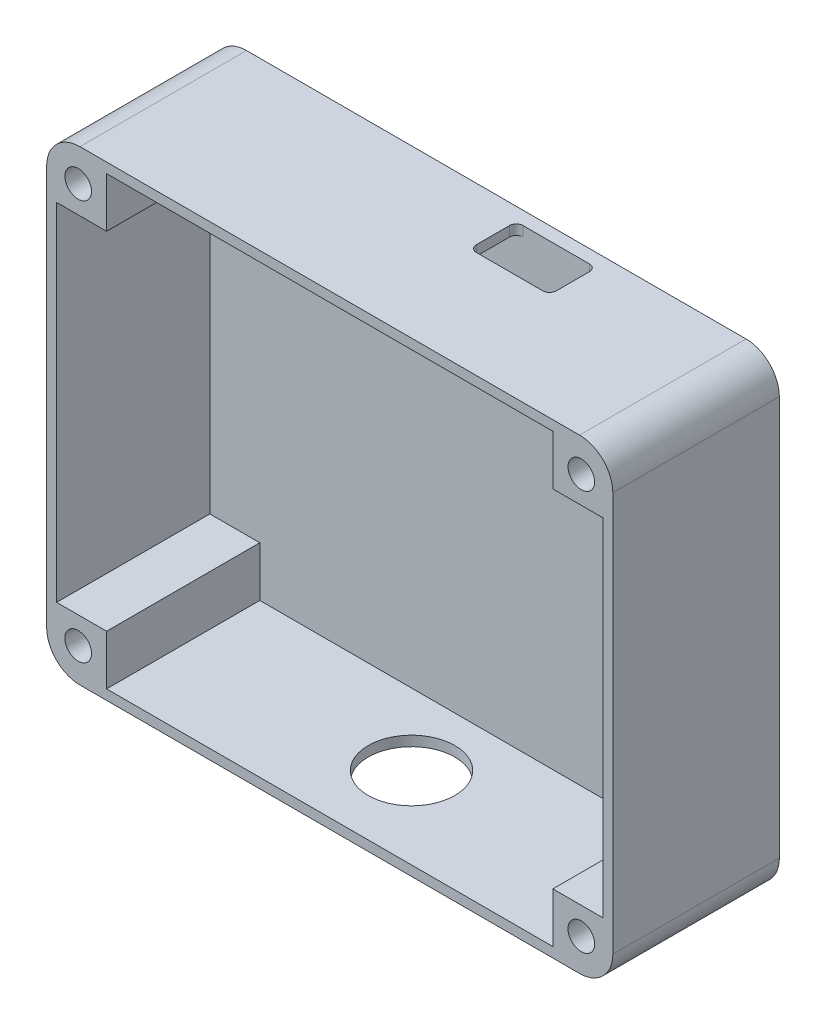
from build123d import *

# Parameters (mm, degrees)
BOSS_EXTRUDE1_DEPTH = 25
CUT_EXTRUDE1_DEPTH  = 23
SKETCH3_R           = 2
CUT_EXTRUDE2_DEPTH  = 23
CUT_EXTRUDE4_DEPTH  = 4
SKETCH5_R           = 6.5
CUT_EXTRUDE5_DEPTH  = 4


with BuildPart() as part:
    # Sketch1 → Boss-Extrude1 (new body)
    with BuildSketch(Plane.XY):
        with BuildLine():
            Line((-37.5, 35), (37.5, 35))
            ThreePointArc((37.5, 35), (41.035533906, 33.535533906), (42.5, 30))
            Line((42.5, 30), (42.5, -30))
            ThreePointArc((42.5, -30), (41.035533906, -33.535533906), (37.5, -35))
            Line((37.5, -35), (-37.5, -35))
            ThreePointArc((-37.5, -35), (-41.035533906, -33.535533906), (-42.5, -30))
            Line((-42.5, -30), (-42.5, 30))
            ThreePointArc((-42.5, 30), (-41.035533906, 33.535533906), (-37.5, 35))
        make_face()
    extrude(amount=BOSS_EXTRUDE1_DEPTH)

    # Sketch2 → Cut-Extrude1 (cut)
    with BuildSketch(Plane.XY.offset(25)):
        Polygon((33.5, 33.5), (-33.5, 33.5), (-33.5, 26), (-41, 26), (-41, -26), (-33.5, -26), (-33.5, -33.5), (33.5, -33.5), (33.5, -26), (41, -26), (41, 26), (33.5, 26), align=None)
    extrude(amount=-CUT_EXTRUDE1_DEPTH, mode=Mode.SUBTRACT)

    # Sketch3 → Cut-Extrude2 (cut)
    with BuildSketch(Plane.XY.offset(25)):
        with Locations((-37.768024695, 30.036604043)):
            Circle(SKETCH3_R)
        with Locations(Location((37.768024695, 30.036604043, 0), (0, 0, 180))):
            Circle(SKETCH3_R)
        with Locations((37.768024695, -30.036604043)):
            Circle(SKETCH3_R)
        with Locations(Location((-37.768024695, -30.036604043, 0), (0, 0, 180))):
            Circle(SKETCH3_R)
    extrude(amount=-CUT_EXTRUDE2_DEPTH, mode=Mode.SUBTRACT)

    # Sketch4 → Cut-Extrude4 (cut)
    with BuildSketch(Plane(origin=(0, 35, 0), x_dir=(1, 0, 0), z_dir=(0, 1, 0))):
        with BuildLine():
            Line((6, -2), (16, -2))
            ThreePointArc((16, -2), (16.707106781, -2.292893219), (17, -3))
            Line((17, -3), (17, -8))
            ThreePointArc((17, -8), (16.707106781, -8.707106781), (16, -9))
            Line((16, -9), (6, -9))
            ThreePointArc((6, -9), (5.292893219, -8.707106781), (5, -8))
            Line((5, -8), (5, -3))
            ThreePointArc((5, -3), (5.292893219, -2.292893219), (6, -2))
        make_face()
    extrude(amount=-CUT_EXTRUDE4_DEPTH, mode=Mode.SUBTRACT)

    # Sketch5 → Cut-Extrude5 (cut)
    with BuildSketch(Plane.XZ.offset(35)):
        with Locations(Location((0, 12.721070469, 0), (0, 0, 270))):
            Circle(SKETCH5_R)
    extrude(amount=-CUT_EXTRUDE5_DEPTH, mode=Mode.SUBTRACT)


solid = part.part
